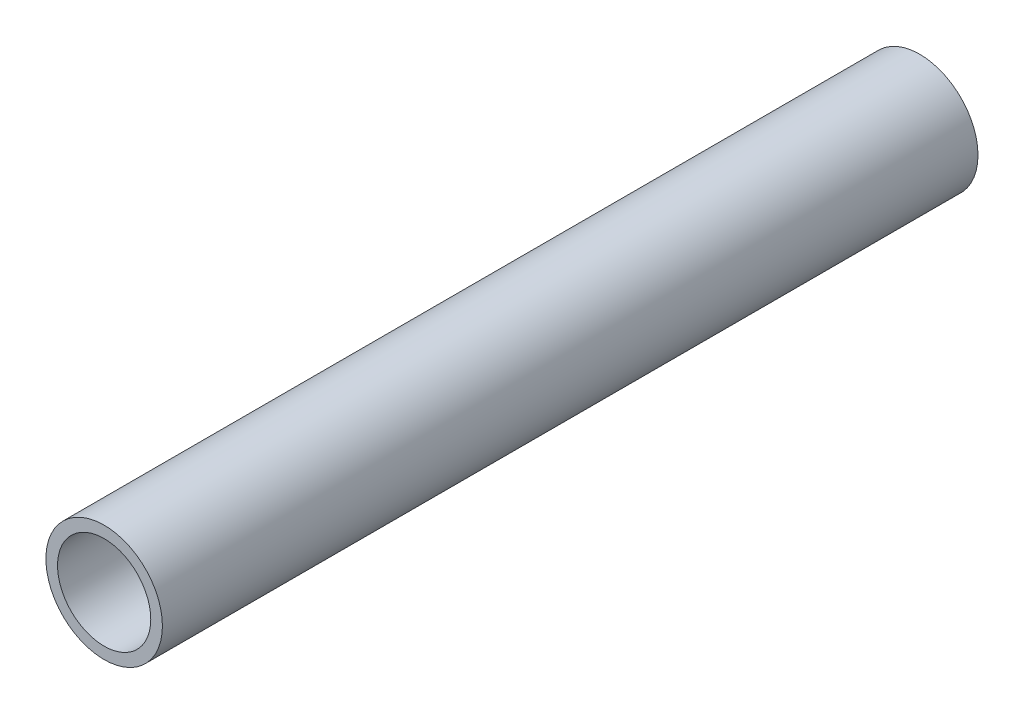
from build123d import *

# Parameters (mm, degrees)
SKETCH1_R           = 3.175
SKETCH1_R_2         = 2.54
EXTRUDE_THIN1_DEPTH = 22.225


with BuildPart() as part:
    # Sketch1 → Extrude-Thin1 (new, symmetric)
    with BuildSketch(Plane.XY):
        Circle(SKETCH1_R)
        Circle(SKETCH1_R_2, mode=Mode.SUBTRACT)
    extrude(amount=EXTRUDE_THIN1_DEPTH, both=True)


solid = part.part
